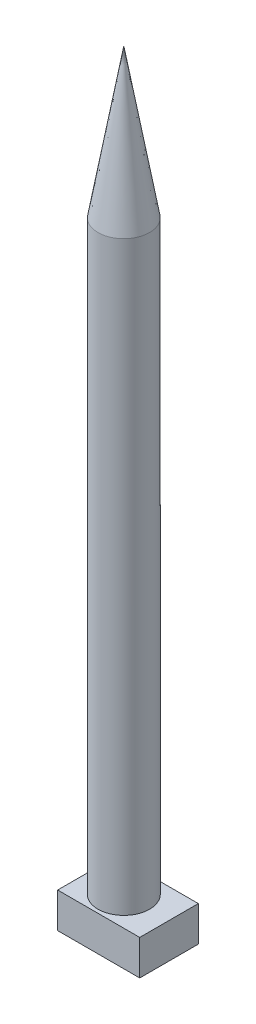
ISO-10303-21;
HEADER;
FILE_DESCRIPTION(('STEP AP214'),'2;1');
FILE_NAME('part.step','',(''),(''),'','','');
FILE_SCHEMA(('AUTOMOTIVE_DESIGN { 1 0 10303 214 1 1 1 1 }'));
ENDSEC;
DATA;
#1=APPLICATION_CONTEXT('core data for automotive mechanical design processes');
#2=APPLICATION_PROTOCOL_DEFINITION('international standard','automotive_design',2000,#1);
#3=PRODUCT_CONTEXT('',#1,'mechanical');
#4=PRODUCT('Part','Part','',(#3));
#5=PRODUCT_RELATED_PRODUCT_CATEGORY('part','',(#4));
#6=PRODUCT_DEFINITION_FORMATION('','',#4);
#7=PRODUCT_DEFINITION_CONTEXT('part definition',#1,'design');
#8=PRODUCT_DEFINITION('design','',#6,#7);
#9=PRODUCT_DEFINITION_SHAPE('','',#8);
#10=(LENGTH_UNIT() NAMED_UNIT(*) SI_UNIT(.MILLI.,.METRE.));
#11=(NAMED_UNIT(*) PLANE_ANGLE_UNIT() SI_UNIT($,.RADIAN.));
#12=(NAMED_UNIT(*) SI_UNIT($,.STERADIAN.) SOLID_ANGLE_UNIT());
#13=UNCERTAINTY_MEASURE_WITH_UNIT(LENGTH_MEASURE(1.E-05),#10,'distance_accuracy_value','');
#14=(GEOMETRIC_REPRESENTATION_CONTEXT(3) GLOBAL_UNCERTAINTY_ASSIGNED_CONTEXT((#13)) GLOBAL_UNIT_ASSIGNED_CONTEXT((#10,
#11,#12)) REPRESENTATION_CONTEXT('',''));
#15=CARTESIAN_POINT('',(0.,0.,0.));
#16=DIRECTION('',(0.,0.,1.));
#17=DIRECTION('',(1.,0.,0.));
#18=AXIS2_PLACEMENT_3D('',#15,#16,#17);
#19=CARTESIAN_POINT('',(0.,30.,50.));
#20=DIRECTION('',(0.,1.,0.));
#21=DIRECTION('',(0.,0.,1.));
#22=AXIS2_PLACEMENT_3D('',#19,#20,#21);
#23=PLANE('',#22);
#24=DIRECTION('',(0.,0.,1.));
#25=VECTOR('',#24,1.);
#26=CARTESIAN_POINT('',(0.,30.,0.));
#27=LINE('',#26,#25);
#28=CARTESIAN_POINT('',(0.,30.,0.));
#29=VERTEX_POINT('',#28);
#30=CARTESIAN_POINT('',(0.,30.,50.));
#31=VERTEX_POINT('',#30);
#32=EDGE_CURVE('E127',#29,#31,#27,.T.);
#33=ORIENTED_EDGE('',*,*,#32,.T.);
#34=DIRECTION('',(1.,0.,0.));
#35=VECTOR('',#34,1.);
#36=CARTESIAN_POINT('',(0.,30.,50.));
#37=LINE('',#36,#35);
#38=CARTESIAN_POINT('',(70.,30.,50.));
#39=VERTEX_POINT('',#38);
#40=EDGE_CURVE('E81',#31,#39,#37,.T.);
#41=ORIENTED_EDGE('',*,*,#40,.T.);
#42=DIRECTION('',(0.,0.,-1.));
#43=VECTOR('',#42,1.);
#44=CARTESIAN_POINT('',(70.,30.,0.));
#45=LINE('',#44,#43);
#46=CARTESIAN_POINT('',(70.,30.,0.));
#47=VERTEX_POINT('',#46);
#48=EDGE_CURVE('E124',#39,#47,#45,.T.);
#49=ORIENTED_EDGE('',*,*,#48,.T.);
#50=DIRECTION('',(-1.,0.,0.));
#51=VECTOR('',#50,1.);
#52=CARTESIAN_POINT('',(0.,30.,0.));
#53=LINE('',#52,#51);
#54=EDGE_CURVE('E50',#47,#29,#53,.T.);
#55=ORIENTED_EDGE('',*,*,#54,.T.);
#56=EDGE_LOOP('',(#33,#41,#49,#55));
#57=FACE_BOUND('',#56,.T.);
#58=CARTESIAN_POINT('',(31.4355321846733,30.,25.));
#59=DIRECTION('',(0.,1.,0.));
#60=DIRECTION('',(0.,0.,1.));
#61=AXIS2_PLACEMENT_3D('',#58,#59,#60);
#62=CIRCLE('',#61,22.);
#63=CARTESIAN_POINT('',(31.4355321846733,30.,47.));
#64=VERTEX_POINT('',#63);
#65=EDGE_CURVE('E138',#64,#64,#62,.T.);
#66=ORIENTED_EDGE('',*,*,#65,.F.);
#67=EDGE_LOOP('',(#66));
#68=FACE_BOUND('',#67,.T.);
#69=ADVANCED_FACE('F33',(#57,#68),#23,.T.);
#70=CARTESIAN_POINT('',(0.,30.,0.));
#71=DIRECTION('',(1.,0.,0.));
#72=DIRECTION('',(0.,0.,-1.));
#73=AXIS2_PLACEMENT_3D('',#70,#71,#72);
#74=PLANE('',#73);
#75=DIRECTION('',(0.,0.,1.));
#76=VECTOR('',#75,1.);
#77=CARTESIAN_POINT('',(0.,0.,0.));
#78=LINE('',#77,#76);
#79=CARTESIAN_POINT('',(0.,0.,0.));
#80=VERTEX_POINT('',#79);
#81=CARTESIAN_POINT('',(0.,0.,50.));
#82=VERTEX_POINT('',#81);
#83=EDGE_CURVE('E122',#80,#82,#78,.T.);
#84=ORIENTED_EDGE('',*,*,#83,.T.);
#85=DIRECTION('',(0.,-1.,0.));
#86=VECTOR('',#85,1.);
#87=CARTESIAN_POINT('',(0.,30.,50.));
#88=LINE('',#87,#86);
#89=EDGE_CURVE('E12',#31,#82,#88,.T.);
#90=ORIENTED_EDGE('',*,*,#89,.F.);
#91=ORIENTED_EDGE('',*,*,#32,.F.);
#92=DIRECTION('',(0.,-1.,0.));
#93=VECTOR('',#92,1.);
#94=CARTESIAN_POINT('',(0.,30.,0.));
#95=LINE('',#94,#93);
#96=EDGE_CURVE('E131',#29,#80,#95,.T.);
#97=ORIENTED_EDGE('',*,*,#96,.T.);
#98=EDGE_LOOP('',(#84,#90,#91,#97));
#99=FACE_BOUND('',#98,.T.);
#100=ADVANCED_FACE('F35',(#99),#74,.F.);
#101=CARTESIAN_POINT('',(0.,30.,50.));
#102=DIRECTION('',(0.,0.,-1.));
#103=DIRECTION('',(-1.,0.,0.));
#104=AXIS2_PLACEMENT_3D('',#101,#102,#103);
#105=PLANE('',#104);
#106=DIRECTION('',(1.,0.,0.));
#107=VECTOR('',#106,1.);
#108=CARTESIAN_POINT('',(0.,0.,50.));
#109=LINE('',#108,#107);
#110=CARTESIAN_POINT('',(70.,0.,50.));
#111=VERTEX_POINT('',#110);
#112=EDGE_CURVE('E117',#82,#111,#109,.T.);
#113=ORIENTED_EDGE('',*,*,#112,.T.);
#114=DIRECTION('',(0.,-1.,0.));
#115=VECTOR('',#114,1.);
#116=CARTESIAN_POINT('',(70.,30.,50.));
#117=LINE('',#116,#115);
#118=EDGE_CURVE('E42',#39,#111,#117,.T.);
#119=ORIENTED_EDGE('',*,*,#118,.F.);
#120=ORIENTED_EDGE('',*,*,#40,.F.);
#121=ORIENTED_EDGE('',*,*,#89,.T.);
#122=EDGE_LOOP('',(#113,#119,#120,#121));
#123=FACE_BOUND('',#122,.T.);
#124=ADVANCED_FACE('F102',(#123),#105,.F.);
#125=CARTESIAN_POINT('',(70.,30.,0.));
#126=DIRECTION('',(-1.,0.,0.));
#127=DIRECTION('',(0.,0.,1.));
#128=AXIS2_PLACEMENT_3D('',#125,#126,#127);
#129=PLANE('',#128);
#130=DIRECTION('',(0.,0.,-1.));
#131=VECTOR('',#130,1.);
#132=CARTESIAN_POINT('',(70.,0.,0.));
#133=LINE('',#132,#131);
#134=CARTESIAN_POINT('',(70.,0.,0.));
#135=VERTEX_POINT('',#134);
#136=EDGE_CURVE('E68',#111,#135,#133,.T.);
#137=ORIENTED_EDGE('',*,*,#136,.T.);
#138=DIRECTION('',(0.,-1.,0.));
#139=VECTOR('',#138,1.);
#140=CARTESIAN_POINT('',(70.,30.,0.));
#141=LINE('',#140,#139);
#142=EDGE_CURVE('E125',#47,#135,#141,.T.);
#143=ORIENTED_EDGE('',*,*,#142,.F.);
#144=ORIENTED_EDGE('',*,*,#48,.F.);
#145=ORIENTED_EDGE('',*,*,#118,.T.);
#146=EDGE_LOOP('',(#137,#143,#144,#145));
#147=FACE_BOUND('',#146,.T.);
#148=ADVANCED_FACE('F112',(#147),#129,.F.);
#149=CARTESIAN_POINT('',(0.,30.,0.));
#150=DIRECTION('',(0.,0.,1.));
#151=DIRECTION('',(1.,0.,0.));
#152=AXIS2_PLACEMENT_3D('',#149,#150,#151);
#153=PLANE('',#152);
#154=DIRECTION('',(-1.,0.,0.));
#155=VECTOR('',#154,1.);
#156=CARTESIAN_POINT('',(0.,0.,0.));
#157=LINE('',#156,#155);
#158=EDGE_CURVE('E74',#135,#80,#157,.T.);
#159=ORIENTED_EDGE('',*,*,#158,.T.);
#160=ORIENTED_EDGE('',*,*,#96,.F.);
#161=ORIENTED_EDGE('',*,*,#54,.F.);
#162=ORIENTED_EDGE('',*,*,#142,.T.);
#163=EDGE_LOOP('',(#159,#160,#161,#162));
#164=FACE_BOUND('',#163,.T.);
#165=ADVANCED_FACE('F108',(#164),#153,.F.);
#166=CARTESIAN_POINT('',(0.,0.,50.));
#167=DIRECTION('',(0.,1.,0.));
#168=DIRECTION('',(0.,0.,1.));
#169=AXIS2_PLACEMENT_3D('',#166,#167,#168);
#170=PLANE('',#169);
#171=ORIENTED_EDGE('',*,*,#83,.F.);
#172=ORIENTED_EDGE('',*,*,#158,.F.);
#173=ORIENTED_EDGE('',*,*,#136,.F.);
#174=ORIENTED_EDGE('',*,*,#112,.F.);
#175=EDGE_LOOP('',(#171,#172,#173,#174));
#176=FACE_BOUND('',#175,.T.);
#177=ADVANCED_FACE('F93',(#176),#170,.F.);
#178=CARTESIAN_POINT('',(31.4355321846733,530.,25.));
#179=DIRECTION('',(0.,-1.,0.));
#180=DIRECTION('',(0.,0.,-1.));
#181=AXIS2_PLACEMENT_3D('',#178,#179,#180);
#182=CYLINDRICAL_SURFACE('',#181,22.);
#183=CARTESIAN_POINT('',(31.4355321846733,530.,25.));
#184=DIRECTION('',(0.,1.,0.));
#185=DIRECTION('',(0.,0.,1.));
#186=AXIS2_PLACEMENT_3D('',#183,#184,#185);
#187=CIRCLE('',#186,22.);
#188=CARTESIAN_POINT('',(31.4355321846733,530.,47.));
#189=VERTEX_POINT('',#188);
#190=EDGE_CURVE('E137',#189,#189,#187,.T.);
#191=ORIENTED_EDGE('',*,*,#190,.F.);
#192=EDGE_LOOP('',(#191));
#193=FACE_BOUND('',#192,.T.);
#194=ORIENTED_EDGE('',*,*,#65,.T.);
#195=EDGE_LOOP('',(#194));
#196=FACE_BOUND('',#195,.T.);
#197=ADVANCED_FACE('F87',(#193,#196),#182,.T.);
#198=CARTESIAN_POINT('',(31.4355321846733,656.823714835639,25.));
#199=DIRECTION('',(0.,-1.,0.));
#200=DIRECTION('',(0.,0.,-1.));
#201=AXIS2_PLACEMENT_3D('',#198,#199,#200);
#202=CONICAL_SURFACE('',#201,0.,0.171759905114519);
#203=ORIENTED_EDGE('',*,*,#190,.T.);
#204=EDGE_LOOP('',(#203));
#205=FACE_BOUND('',#204,.T.);
#206=CARTESIAN_POINT('',(31.4355321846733,656.823714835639,25.));
#207=VERTEX_POINT('',#206);
#208=VERTEX_LOOP('',#207);
#209=FACE_BOUND('',#208,.T.);
#210=ADVANCED_FACE('F85',(#205,#209),#202,.T.);
#211=CLOSED_SHELL('',(#69,#100,#124,#148,#165,#177,#197,#210));
#212=MANIFOLD_SOLID_BREP('B2',#211);
#213=ADVANCED_BREP_SHAPE_REPRESENTATION('',(#18,#212),#14);
#214=SHAPE_DEFINITION_REPRESENTATION(#9,#213);
ENDSEC;
END-ISO-10303-21;
